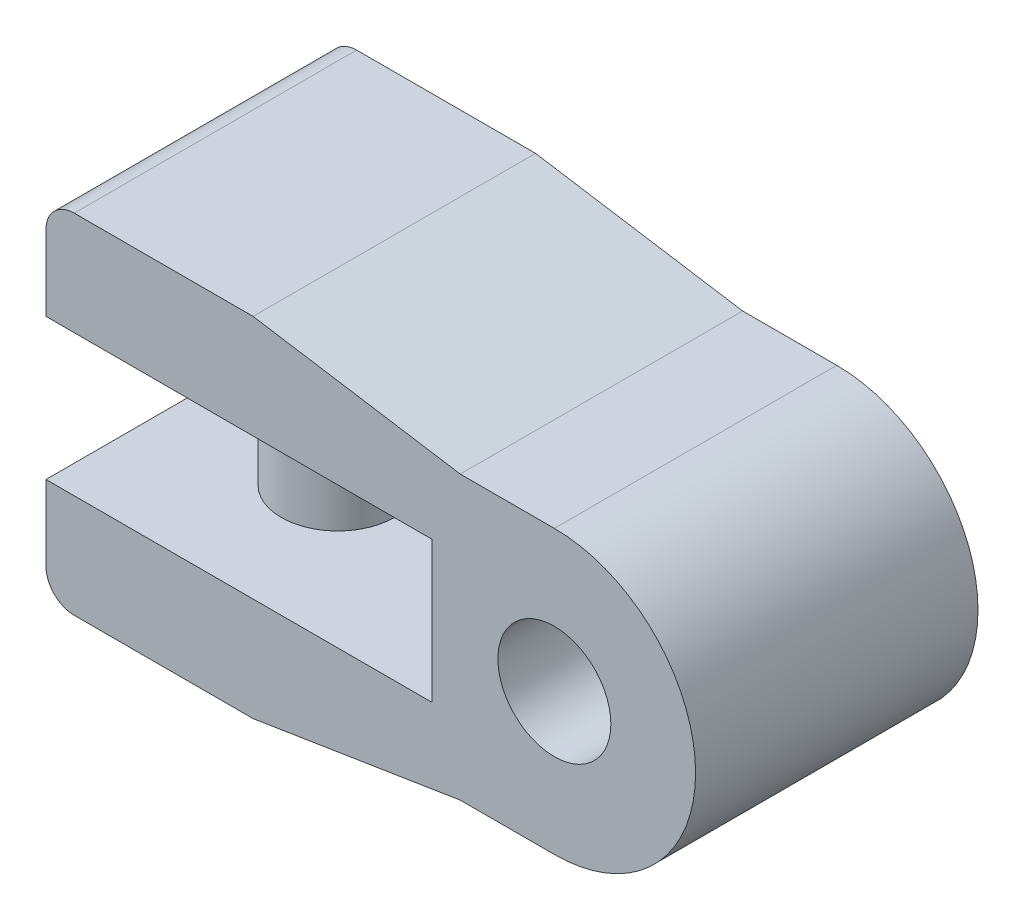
ISO-10303-21;
HEADER;
FILE_DESCRIPTION(('STEP AP214'),'2;1');
FILE_NAME('part.step','',(''),(''),'','','');
FILE_SCHEMA(('AUTOMOTIVE_DESIGN { 1 0 10303 214 1 1 1 1 }'));
ENDSEC;
DATA;
#1=APPLICATION_CONTEXT('core data for automotive mechanical design processes');
#2=APPLICATION_PROTOCOL_DEFINITION('international standard','automotive_design',2000,#1);
#3=PRODUCT_CONTEXT('',#1,'mechanical');
#4=PRODUCT('Part','Part','',(#3));
#5=PRODUCT_RELATED_PRODUCT_CATEGORY('part','',(#4));
#6=PRODUCT_DEFINITION_FORMATION('','',#4);
#7=PRODUCT_DEFINITION_CONTEXT('part definition',#1,'design');
#8=PRODUCT_DEFINITION('design','',#6,#7);
#9=PRODUCT_DEFINITION_SHAPE('','',#8);
#10=(LENGTH_UNIT() NAMED_UNIT(*) SI_UNIT(.MILLI.,.METRE.));
#11=(NAMED_UNIT(*) PLANE_ANGLE_UNIT() SI_UNIT($,.RADIAN.));
#12=(NAMED_UNIT(*) SI_UNIT($,.STERADIAN.) SOLID_ANGLE_UNIT());
#13=UNCERTAINTY_MEASURE_WITH_UNIT(LENGTH_MEASURE(1.E-05),#10,'distance_accuracy_value','');
#14=(GEOMETRIC_REPRESENTATION_CONTEXT(3) GLOBAL_UNCERTAINTY_ASSIGNED_CONTEXT((#13)) GLOBAL_UNIT_ASSIGNED_CONTEXT((#10,
#11,#12)) REPRESENTATION_CONTEXT('',''));
#15=CARTESIAN_POINT('',(0.,0.,0.));
#16=DIRECTION('',(0.,0.,1.));
#17=DIRECTION('',(1.,0.,0.));
#18=AXIS2_PLACEMENT_3D('',#15,#16,#17);
#19=CARTESIAN_POINT('',(41.,7.5,30.));
#20=DIRECTION('',(0.,1.,0.));
#21=DIRECTION('',(-1.,0.,0.));
#22=AXIS2_PLACEMENT_3D('',#19,#20,#21);
#23=PLANE('',#22);
#24=CARTESIAN_POINT('',(16.,7.5,15.));
#25=DIRECTION('',(0.,1.,0.));
#26=DIRECTION('',(-1.,0.,0.));
#27=AXIS2_PLACEMENT_3D('',#24,#25,#26);
#28=CIRCLE('',#27,6.);
#29=CARTESIAN_POINT('',(10.,7.5,15.));
#30=VERTEX_POINT('',#29);
#31=EDGE_CURVE('E255',#30,#30,#28,.T.);
#32=ORIENTED_EDGE('',*,*,#31,.T.);
#33=EDGE_LOOP('',(#32));
#34=FACE_BOUND('',#33,.T.);
#35=DIRECTION('',(1.,0.,0.));
#36=VECTOR('',#35,1.);
#37=CARTESIAN_POINT('',(41.,7.5,0.));
#38=LINE('',#37,#36);
#39=CARTESIAN_POINT('',(0.,7.5,0.));
#40=VERTEX_POINT('',#39);
#41=CARTESIAN_POINT('',(41.,7.5,0.));
#42=VERTEX_POINT('',#41);
#43=EDGE_CURVE('E154',#40,#42,#38,.T.);
#44=ORIENTED_EDGE('',*,*,#43,.T.);
#45=DIRECTION('',(0.,0.,-1.));
#46=VECTOR('',#45,1.);
#47=CARTESIAN_POINT('',(41.,7.5,30.));
#48=LINE('',#47,#46);
#49=CARTESIAN_POINT('',(41.,7.5,30.));
#50=VERTEX_POINT('',#49);
#51=EDGE_CURVE('E135',#50,#42,#48,.T.);
#52=ORIENTED_EDGE('',*,*,#51,.F.);
#53=DIRECTION('',(1.,0.,0.));
#54=VECTOR('',#53,1.);
#55=CARTESIAN_POINT('',(41.,7.5,30.));
#56=LINE('',#55,#54);
#57=CARTESIAN_POINT('',(0.,7.5,30.));
#58=VERTEX_POINT('',#57);
#59=EDGE_CURVE('E141',#58,#50,#56,.T.);
#60=ORIENTED_EDGE('',*,*,#59,.F.);
#61=DIRECTION('',(0.,0.,-1.));
#62=VECTOR('',#61,1.);
#63=CARTESIAN_POINT('',(0.,7.5,30.));
#64=LINE('',#63,#62);
#65=EDGE_CURVE('E208',#58,#40,#64,.T.);
#66=ORIENTED_EDGE('',*,*,#65,.T.);
#67=EDGE_LOOP('',(#44,#52,#60,#66));
#68=FACE_BOUND('',#67,.T.);
#69=ADVANCED_FACE('F30',(#34,#68),#23,.F.);
#70=CARTESIAN_POINT('',(41.,-7.5,30.));
#71=DIRECTION('',(1.,0.,0.));
#72=DIRECTION('',(0.,0.,-1.));
#73=AXIS2_PLACEMENT_3D('',#70,#71,#72);
#74=PLANE('',#73);
#75=DIRECTION('',(0.,-1.,0.));
#76=VECTOR('',#75,1.);
#77=CARTESIAN_POINT('',(41.,-7.5,0.));
#78=LINE('',#77,#76);
#79=CARTESIAN_POINT('',(41.,-7.5,0.));
#80=VERTEX_POINT('',#79);
#81=EDGE_CURVE('E231',#42,#80,#78,.T.);
#82=ORIENTED_EDGE('',*,*,#81,.T.);
#83=DIRECTION('',(0.,0.,-1.));
#84=VECTOR('',#83,1.);
#85=CARTESIAN_POINT('',(41.,-7.5,30.));
#86=LINE('',#85,#84);
#87=CARTESIAN_POINT('',(41.,-7.5,30.));
#88=VERTEX_POINT('',#87);
#89=EDGE_CURVE('E138',#88,#80,#86,.T.);
#90=ORIENTED_EDGE('',*,*,#89,.F.);
#91=DIRECTION('',(0.,-1.,0.));
#92=VECTOR('',#91,1.);
#93=CARTESIAN_POINT('',(41.,-7.5,30.));
#94=LINE('',#93,#92);
#95=EDGE_CURVE('E131',#50,#88,#94,.T.);
#96=ORIENTED_EDGE('',*,*,#95,.F.);
#97=ORIENTED_EDGE('',*,*,#51,.T.);
#98=EDGE_LOOP('',(#82,#90,#96,#97));
#99=FACE_BOUND('',#98,.T.);
#100=ADVANCED_FACE('F133',(#99),#74,.F.);
#101=CARTESIAN_POINT('',(41.,-7.5,30.));
#102=DIRECTION('',(0.,-1.,0.));
#103=DIRECTION('',(1.,0.,0.));
#104=AXIS2_PLACEMENT_3D('',#101,#102,#103);
#105=PLANE('',#104);
#106=CARTESIAN_POINT('',(16.,-7.5,15.));
#107=DIRECTION('',(0.,-1.,0.));
#108=DIRECTION('',(1.,0.,0.));
#109=AXIS2_PLACEMENT_3D('',#106,#107,#108);
#110=CIRCLE('',#109,6.);
#111=CARTESIAN_POINT('',(22.,-7.5,15.));
#112=VERTEX_POINT('',#111);
#113=EDGE_CURVE('E260',#112,#112,#110,.T.);
#114=ORIENTED_EDGE('',*,*,#113,.T.);
#115=EDGE_LOOP('',(#114));
#116=FACE_BOUND('',#115,.T.);
#117=DIRECTION('',(-1.,0.,0.));
#118=VECTOR('',#117,1.);
#119=CARTESIAN_POINT('',(41.,-7.5,0.));
#120=LINE('',#119,#118);
#121=CARTESIAN_POINT('',(0.,-7.5,0.));
#122=VERTEX_POINT('',#121);
#123=EDGE_CURVE('E192',#80,#122,#120,.T.);
#124=ORIENTED_EDGE('',*,*,#123,.T.);
#125=DIRECTION('',(0.,0.,-1.));
#126=VECTOR('',#125,1.);
#127=CARTESIAN_POINT('',(0.,-7.5,30.));
#128=LINE('',#127,#126);
#129=CARTESIAN_POINT('',(0.,-7.5,30.));
#130=VERTEX_POINT('',#129);
#131=EDGE_CURVE('E160',#130,#122,#128,.T.);
#132=ORIENTED_EDGE('',*,*,#131,.F.);
#133=DIRECTION('',(-1.,0.,0.));
#134=VECTOR('',#133,1.);
#135=CARTESIAN_POINT('',(41.,-7.5,30.));
#136=LINE('',#135,#134);
#137=EDGE_CURVE('E140',#88,#130,#136,.T.);
#138=ORIENTED_EDGE('',*,*,#137,.F.);
#139=ORIENTED_EDGE('',*,*,#89,.T.);
#140=EDGE_LOOP('',(#124,#132,#138,#139));
#141=FACE_BOUND('',#140,.T.);
#142=ADVANCED_FACE('F264',(#116,#141),#105,.F.);
#143=CARTESIAN_POINT('',(0.,-7.5,30.));
#144=DIRECTION('',(1.,0.,0.));
#145=DIRECTION('',(0.,1.,0.));
#146=AXIS2_PLACEMENT_3D('',#143,#144,#145);
#147=PLANE('',#146);
#148=DIRECTION('',(0.,-1.,0.));
#149=VECTOR('',#148,1.);
#150=CARTESIAN_POINT('',(0.,-7.5,0.));
#151=LINE('',#150,#149);
#152=CARTESIAN_POINT('',(0.,-15.5,0.));
#153=VERTEX_POINT('',#152);
#154=EDGE_CURVE('E188',#122,#153,#151,.T.);
#155=ORIENTED_EDGE('',*,*,#154,.T.);
#156=DIRECTION('',(0.,0.,-1.));
#157=VECTOR('',#156,1.);
#158=CARTESIAN_POINT('',(0.,-15.5,30.));
#159=LINE('',#158,#157);
#160=CARTESIAN_POINT('',(0.,-15.5,30.));
#161=VERTEX_POINT('',#160);
#162=EDGE_CURVE('E11',#153,#161,#159,.F.);
#163=ORIENTED_EDGE('',*,*,#162,.T.);
#164=DIRECTION('',(0.,-1.,0.));
#165=VECTOR('',#164,1.);
#166=CARTESIAN_POINT('',(0.,-7.5,30.));
#167=LINE('',#166,#165);
#168=EDGE_CURVE('E228',#130,#161,#167,.T.);
#169=ORIENTED_EDGE('',*,*,#168,.F.);
#170=ORIENTED_EDGE('',*,*,#131,.T.);
#171=EDGE_LOOP('',(#155,#163,#169,#170));
#172=FACE_BOUND('',#171,.T.);
#173=ADVANCED_FACE('F227',(#172),#147,.F.);
#174=CARTESIAN_POINT('',(0.,-18.5,30.));
#175=DIRECTION('',(0.,1.,0.));
#176=DIRECTION('',(0.,0.,1.));
#177=AXIS2_PLACEMENT_3D('',#174,#175,#176);
#178=PLANE('',#177);
#179=DIRECTION('',(1.,0.,0.));
#180=VECTOR('',#179,1.);
#181=CARTESIAN_POINT('',(0.,-18.5,0.));
#182=LINE('',#181,#180);
#183=CARTESIAN_POINT('',(3.,-18.5,0.));
#184=VERTEX_POINT('',#183);
#185=CARTESIAN_POINT('',(22.,-18.5,0.));
#186=VERTEX_POINT('',#185);
#187=EDGE_CURVE('E178',#184,#186,#182,.T.);
#188=ORIENTED_EDGE('',*,*,#187,.T.);
#189=DIRECTION('',(0.,0.,-1.));
#190=VECTOR('',#189,1.);
#191=CARTESIAN_POINT('',(22.,-18.5,30.));
#192=LINE('',#191,#190);
#193=CARTESIAN_POINT('',(22.,-18.5,30.));
#194=VERTEX_POINT('',#193);
#195=EDGE_CURVE('E224',#194,#186,#192,.T.);
#196=ORIENTED_EDGE('',*,*,#195,.F.);
#197=DIRECTION('',(1.,0.,0.));
#198=VECTOR('',#197,1.);
#199=CARTESIAN_POINT('',(0.,-18.5,30.));
#200=LINE('',#199,#198);
#201=CARTESIAN_POINT('',(3.,-18.5,30.));
#202=VERTEX_POINT('',#201);
#203=EDGE_CURVE('E180',#202,#194,#200,.T.);
#204=ORIENTED_EDGE('',*,*,#203,.F.);
#205=DIRECTION('',(0.,0.,-1.));
#206=VECTOR('',#205,1.);
#207=CARTESIAN_POINT('',(3.,-18.5,30.));
#208=LINE('',#207,#206);
#209=EDGE_CURVE('E38',#202,#184,#208,.T.);
#210=ORIENTED_EDGE('',*,*,#209,.T.);
#211=EDGE_LOOP('',(#188,#196,#204,#210));
#212=FACE_BOUND('',#211,.T.);
#213=ADVANCED_FACE('F176',(#212),#178,.F.);
#214=CARTESIAN_POINT('',(22.,-18.5,30.));
#215=DIRECTION('',(-0.157115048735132,0.987580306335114,0.));
#216=DIRECTION('',(-0.987580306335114,-0.157115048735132,0.));
#217=AXIS2_PLACEMENT_3D('',#214,#215,#216);
#218=PLANE('',#217);
#219=DIRECTION('',(0.987580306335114,0.157115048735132,0.));
#220=VECTOR('',#219,1.);
#221=CARTESIAN_POINT('',(22.,-18.5,0.));
#222=LINE('',#221,#220);
#223=CARTESIAN_POINT('',(44.,-15.,0.));
#224=VERTEX_POINT('',#223);
#225=EDGE_CURVE('E187',#186,#224,#222,.T.);
#226=ORIENTED_EDGE('',*,*,#225,.T.);
#227=DIRECTION('',(0.,0.,-1.));
#228=VECTOR('',#227,1.);
#229=CARTESIAN_POINT('',(44.,-15.,30.));
#230=LINE('',#229,#228);
#231=CARTESIAN_POINT('',(44.,-15.,30.));
#232=VERTEX_POINT('',#231);
#233=EDGE_CURVE('E221',#232,#224,#230,.T.);
#234=ORIENTED_EDGE('',*,*,#233,.F.);
#235=DIRECTION('',(0.987580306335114,0.157115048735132,0.));
#236=VECTOR('',#235,1.);
#237=CARTESIAN_POINT('',(22.,-18.5,30.));
#238=LINE('',#237,#236);
#239=EDGE_CURVE('E247',#194,#232,#238,.T.);
#240=ORIENTED_EDGE('',*,*,#239,.F.);
#241=ORIENTED_EDGE('',*,*,#195,.T.);
#242=EDGE_LOOP('',(#226,#234,#240,#241));
#243=FACE_BOUND('',#242,.T.);
#244=ADVANCED_FACE('F320',(#243),#218,.F.);
#245=CARTESIAN_POINT('',(44.,-15.,30.));
#246=DIRECTION('',(0.,1.,0.));
#247=DIRECTION('',(0.,0.,1.));
#248=AXIS2_PLACEMENT_3D('',#245,#246,#247);
#249=PLANE('',#248);
#250=DIRECTION('',(1.,0.,0.));
#251=VECTOR('',#250,1.);
#252=CARTESIAN_POINT('',(44.,-15.,0.));
#253=LINE('',#252,#251);
#254=CARTESIAN_POINT('',(54.,-15.,0.));
#255=VERTEX_POINT('',#254);
#256=EDGE_CURVE('E190',#224,#255,#253,.T.);
#257=ORIENTED_EDGE('',*,*,#256,.T.);
#258=DIRECTION('',(0.,0.,-1.));
#259=VECTOR('',#258,1.);
#260=CARTESIAN_POINT('',(54.,-15.,30.));
#261=LINE('',#260,#259);
#262=CARTESIAN_POINT('',(54.,-15.,30.));
#263=VERTEX_POINT('',#262);
#264=EDGE_CURVE('E218',#263,#255,#261,.T.);
#265=ORIENTED_EDGE('',*,*,#264,.F.);
#266=DIRECTION('',(1.,0.,0.));
#267=VECTOR('',#266,1.);
#268=CARTESIAN_POINT('',(44.,-15.,30.));
#269=LINE('',#268,#267);
#270=EDGE_CURVE('E245',#232,#263,#269,.T.);
#271=ORIENTED_EDGE('',*,*,#270,.F.);
#272=ORIENTED_EDGE('',*,*,#233,.T.);
#273=EDGE_LOOP('',(#257,#265,#271,#272));
#274=FACE_BOUND('',#273,.T.);
#275=ADVANCED_FACE('F316',(#274),#249,.F.);
#276=CARTESIAN_POINT('',(54.,0.,30.));
#277=DIRECTION('',(0.,0.,-1.));
#278=DIRECTION('',(-1.,0.,0.));
#279=AXIS2_PLACEMENT_3D('',#276,#277,#278);
#280=CYLINDRICAL_SURFACE('',#279,15.);
#281=CARTESIAN_POINT('',(54.,0.,0.));
#282=DIRECTION('',(0.,0.,1.));
#283=DIRECTION('',(-1.,0.,0.));
#284=AXIS2_PLACEMENT_3D('',#281,#282,#283);
#285=CIRCLE('',#284,15.);
#286=CARTESIAN_POINT('',(54.,15.,0.));
#287=VERTEX_POINT('',#286);
#288=EDGE_CURVE('E197',#255,#287,#285,.T.);
#289=ORIENTED_EDGE('',*,*,#288,.T.);
#290=DIRECTION('',(0.,0.,-1.));
#291=VECTOR('',#290,1.);
#292=CARTESIAN_POINT('',(54.,15.,30.));
#293=LINE('',#292,#291);
#294=CARTESIAN_POINT('',(54.,15.,30.));
#295=VERTEX_POINT('',#294);
#296=EDGE_CURVE('E215',#295,#287,#293,.T.);
#297=ORIENTED_EDGE('',*,*,#296,.F.);
#298=CARTESIAN_POINT('',(54.,0.,30.));
#299=DIRECTION('',(0.,0.,1.));
#300=DIRECTION('',(-1.,0.,0.));
#301=AXIS2_PLACEMENT_3D('',#298,#299,#300);
#302=CIRCLE('',#301,15.);
#303=EDGE_CURVE('E243',#263,#295,#302,.T.);
#304=ORIENTED_EDGE('',*,*,#303,.F.);
#305=ORIENTED_EDGE('',*,*,#264,.T.);
#306=EDGE_LOOP('',(#289,#297,#304,#305));
#307=FACE_BOUND('',#306,.T.);
#308=ADVANCED_FACE('F312',(#307),#280,.T.);
#309=CARTESIAN_POINT('',(44.,15.,30.));
#310=DIRECTION('',(0.,-1.,0.));
#311=DIRECTION('',(0.,0.,-1.));
#312=AXIS2_PLACEMENT_3D('',#309,#310,#311);
#313=PLANE('',#312);
#314=DIRECTION('',(-1.,0.,0.));
#315=VECTOR('',#314,1.);
#316=CARTESIAN_POINT('',(44.,15.,0.));
#317=LINE('',#316,#315);
#318=CARTESIAN_POINT('',(44.,15.,0.));
#319=VERTEX_POINT('',#318);
#320=EDGE_CURVE('E199',#287,#319,#317,.T.);
#321=ORIENTED_EDGE('',*,*,#320,.T.);
#322=DIRECTION('',(0.,0.,-1.));
#323=VECTOR('',#322,1.);
#324=CARTESIAN_POINT('',(44.,15.,30.));
#325=LINE('',#324,#323);
#326=CARTESIAN_POINT('',(44.,15.,30.));
#327=VERTEX_POINT('',#326);
#328=EDGE_CURVE('E212',#327,#319,#325,.T.);
#329=ORIENTED_EDGE('',*,*,#328,.F.);
#330=DIRECTION('',(-1.,0.,0.));
#331=VECTOR('',#330,1.);
#332=CARTESIAN_POINT('',(44.,15.,30.));
#333=LINE('',#332,#331);
#334=EDGE_CURVE('E241',#295,#327,#333,.T.);
#335=ORIENTED_EDGE('',*,*,#334,.F.);
#336=ORIENTED_EDGE('',*,*,#296,.T.);
#337=EDGE_LOOP('',(#321,#329,#335,#336));
#338=FACE_BOUND('',#337,.T.);
#339=ADVANCED_FACE('F307',(#338),#313,.F.);
#340=CARTESIAN_POINT('',(22.,18.5,30.));
#341=DIRECTION('',(-0.157115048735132,-0.987580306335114,0.));
#342=DIRECTION('',(0.987580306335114,-0.157115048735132,0.));
#343=AXIS2_PLACEMENT_3D('',#340,#341,#342);
#344=PLANE('',#343);
#345=DIRECTION('',(-0.987580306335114,0.157115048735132,0.));
#346=VECTOR('',#345,1.);
#347=CARTESIAN_POINT('',(22.,18.5,0.));
#348=LINE('',#347,#346);
#349=CARTESIAN_POINT('',(22.,18.5,0.));
#350=VERTEX_POINT('',#349);
#351=EDGE_CURVE('E201',#319,#350,#348,.T.);
#352=ORIENTED_EDGE('',*,*,#351,.T.);
#353=DIRECTION('',(0.,0.,-1.));
#354=VECTOR('',#353,1.);
#355=CARTESIAN_POINT('',(22.,18.5,30.));
#356=LINE('',#355,#354);
#357=CARTESIAN_POINT('',(22.,18.5,30.));
#358=VERTEX_POINT('',#357);
#359=EDGE_CURVE('E210',#358,#350,#356,.T.);
#360=ORIENTED_EDGE('',*,*,#359,.F.);
#361=DIRECTION('',(-0.987580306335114,0.157115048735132,0.));
#362=VECTOR('',#361,1.);
#363=CARTESIAN_POINT('',(22.,18.5,30.));
#364=LINE('',#363,#362);
#365=EDGE_CURVE('E239',#327,#358,#364,.T.);
#366=ORIENTED_EDGE('',*,*,#365,.F.);
#367=ORIENTED_EDGE('',*,*,#328,.T.);
#368=EDGE_LOOP('',(#352,#360,#366,#367));
#369=FACE_BOUND('',#368,.T.);
#370=ADVANCED_FACE('F302',(#369),#344,.F.);
#371=CARTESIAN_POINT('',(0.,18.5,30.));
#372=DIRECTION('',(0.,-1.,0.));
#373=DIRECTION('',(0.,0.,-1.));
#374=AXIS2_PLACEMENT_3D('',#371,#372,#373);
#375=PLANE('',#374);
#376=ORIENTED_EDGE('',*,*,#359,.T.);
#377=DIRECTION('',(-1.,0.,0.));
#378=VECTOR('',#377,1.);
#379=CARTESIAN_POINT('',(0.,18.5,0.));
#380=LINE('',#379,#378);
#381=CARTESIAN_POINT('',(3.,18.5,0.));
#382=VERTEX_POINT('',#381);
#383=EDGE_CURVE('E204',#350,#382,#380,.T.);
#384=ORIENTED_EDGE('',*,*,#383,.T.);
#385=DIRECTION('',(0.,0.,-1.));
#386=VECTOR('',#385,1.);
#387=CARTESIAN_POINT('',(3.,18.5,30.));
#388=LINE('',#387,#386);
#389=CARTESIAN_POINT('',(3.,18.5,30.));
#390=VERTEX_POINT('',#389);
#391=EDGE_CURVE('E167',#382,#390,#388,.F.);
#392=ORIENTED_EDGE('',*,*,#391,.T.);
#393=DIRECTION('',(-1.,0.,0.));
#394=VECTOR('',#393,1.);
#395=CARTESIAN_POINT('',(0.,18.5,30.));
#396=LINE('',#395,#394);
#397=EDGE_CURVE('E237',#358,#390,#396,.T.);
#398=ORIENTED_EDGE('',*,*,#397,.F.);
#399=EDGE_LOOP('',(#376,#384,#392,#398));
#400=FACE_BOUND('',#399,.T.);
#401=ADVANCED_FACE('F298',(#400),#375,.F.);
#402=CARTESIAN_POINT('',(0.,7.5,30.));
#403=DIRECTION('',(1.,0.,0.));
#404=DIRECTION('',(0.,1.,0.));
#405=AXIS2_PLACEMENT_3D('',#402,#403,#404);
#406=PLANE('',#405);
#407=DIRECTION('',(0.,-1.,0.));
#408=VECTOR('',#407,1.);
#409=CARTESIAN_POINT('',(0.,7.5,30.));
#410=LINE('',#409,#408);
#411=CARTESIAN_POINT('',(0.,15.5,30.));
#412=VERTEX_POINT('',#411);
#413=EDGE_CURVE('E147',#412,#58,#410,.T.);
#414=ORIENTED_EDGE('',*,*,#413,.F.);
#415=DIRECTION('',(0.,0.,-1.));
#416=VECTOR('',#415,1.);
#417=CARTESIAN_POINT('',(0.,15.5,30.));
#418=LINE('',#417,#416);
#419=CARTESIAN_POINT('',(0.,15.5,0.));
#420=VERTEX_POINT('',#419);
#421=EDGE_CURVE('E155',#412,#420,#418,.T.);
#422=ORIENTED_EDGE('',*,*,#421,.T.);
#423=DIRECTION('',(0.,-1.,0.));
#424=VECTOR('',#423,1.);
#425=CARTESIAN_POINT('',(0.,7.5,0.));
#426=LINE('',#425,#424);
#427=EDGE_CURVE('E151',#420,#40,#426,.T.);
#428=ORIENTED_EDGE('',*,*,#427,.T.);
#429=ORIENTED_EDGE('',*,*,#65,.F.);
#430=EDGE_LOOP('',(#414,#422,#428,#429));
#431=FACE_BOUND('',#430,.T.);
#432=ADVANCED_FACE('F294',(#431),#406,.F.);
#433=CARTESIAN_POINT('',(54.,0.,30.));
#434=DIRECTION('',(0.,0.,-1.));
#435=DIRECTION('',(-1.,0.,0.));
#436=AXIS2_PLACEMENT_3D('',#433,#434,#435);
#437=PLANE('',#436);
#438=CARTESIAN_POINT('',(54.,0.,30.));
#439=DIRECTION('',(0.,0.,1.));
#440=DIRECTION('',(1.,0.,0.));
#441=AXIS2_PLACEMENT_3D('',#438,#439,#440);
#442=CIRCLE('',#441,6.);
#443=CARTESIAN_POINT('',(60.,0.,30.));
#444=VERTEX_POINT('',#443);
#445=EDGE_CURVE('E252',#444,#444,#442,.T.);
#446=ORIENTED_EDGE('',*,*,#445,.F.);
#447=EDGE_LOOP('',(#446));
#448=FACE_BOUND('',#447,.T.);
#449=ORIENTED_EDGE('',*,*,#397,.T.);
#450=CARTESIAN_POINT('',(3.,15.5,30.));
#451=DIRECTION('',(0.,0.,-1.));
#452=DIRECTION('',(-1.,0.,0.));
#453=AXIS2_PLACEMENT_3D('',#450,#451,#452);
#454=CIRCLE('',#453,3.);
#455=EDGE_CURVE('E170',#390,#412,#454,.F.);
#456=ORIENTED_EDGE('',*,*,#455,.T.);
#457=ORIENTED_EDGE('',*,*,#413,.T.);
#458=ORIENTED_EDGE('',*,*,#59,.T.);
#459=ORIENTED_EDGE('',*,*,#95,.T.);
#460=ORIENTED_EDGE('',*,*,#137,.T.);
#461=ORIENTED_EDGE('',*,*,#168,.T.);
#462=CARTESIAN_POINT('',(3.,-15.5,30.));
#463=DIRECTION('',(0.,0.,-1.));
#464=DIRECTION('',(-1.,0.,0.));
#465=AXIS2_PLACEMENT_3D('',#462,#463,#464);
#466=CIRCLE('',#465,3.);
#467=EDGE_CURVE('E45',#161,#202,#466,.F.);
#468=ORIENTED_EDGE('',*,*,#467,.T.);
#469=ORIENTED_EDGE('',*,*,#203,.T.);
#470=ORIENTED_EDGE('',*,*,#239,.T.);
#471=ORIENTED_EDGE('',*,*,#270,.T.);
#472=ORIENTED_EDGE('',*,*,#303,.T.);
#473=ORIENTED_EDGE('',*,*,#334,.T.);
#474=ORIENTED_EDGE('',*,*,#365,.T.);
#475=EDGE_LOOP('',(#449,#456,#457,#458,#459,#460,#461,#468,#469,#470,#471,#472,#473,#474));
#476=FACE_BOUND('',#475,.T.);
#477=ADVANCED_FACE('F145',(#448,#476),#437,.F.);
#478=CARTESIAN_POINT('',(54.,0.,0.));
#479=DIRECTION('',(0.,0.,-1.));
#480=DIRECTION('',(-1.,0.,0.));
#481=AXIS2_PLACEMENT_3D('',#478,#479,#480);
#482=PLANE('',#481);
#483=CARTESIAN_POINT('',(54.,0.,0.));
#484=DIRECTION('',(0.,0.,1.));
#485=DIRECTION('',(1.,0.,0.));
#486=AXIS2_PLACEMENT_3D('',#483,#484,#485);
#487=CIRCLE('',#486,6.);
#488=CARTESIAN_POINT('',(60.,0.,0.));
#489=VERTEX_POINT('',#488);
#490=EDGE_CURVE('E235',#489,#489,#487,.T.);
#491=ORIENTED_EDGE('',*,*,#490,.T.);
#492=EDGE_LOOP('',(#491));
#493=FACE_BOUND('',#492,.T.);
#494=ORIENTED_EDGE('',*,*,#427,.F.);
#495=CARTESIAN_POINT('',(3.,15.5,0.));
#496=DIRECTION('',(0.,0.,-1.));
#497=DIRECTION('',(-1.,0.,0.));
#498=AXIS2_PLACEMENT_3D('',#495,#496,#497);
#499=CIRCLE('',#498,3.);
#500=EDGE_CURVE('E165',#420,#382,#499,.T.);
#501=ORIENTED_EDGE('',*,*,#500,.T.);
#502=ORIENTED_EDGE('',*,*,#383,.F.);
#503=ORIENTED_EDGE('',*,*,#351,.F.);
#504=ORIENTED_EDGE('',*,*,#320,.F.);
#505=ORIENTED_EDGE('',*,*,#288,.F.);
#506=ORIENTED_EDGE('',*,*,#256,.F.);
#507=ORIENTED_EDGE('',*,*,#225,.F.);
#508=ORIENTED_EDGE('',*,*,#187,.F.);
#509=CARTESIAN_POINT('',(3.,-15.5,0.));
#510=DIRECTION('',(0.,0.,-1.));
#511=DIRECTION('',(-1.,0.,0.));
#512=AXIS2_PLACEMENT_3D('',#509,#510,#511);
#513=CIRCLE('',#512,3.);
#514=EDGE_CURVE('E158',#184,#153,#513,.T.);
#515=ORIENTED_EDGE('',*,*,#514,.T.);
#516=ORIENTED_EDGE('',*,*,#154,.F.);
#517=ORIENTED_EDGE('',*,*,#123,.F.);
#518=ORIENTED_EDGE('',*,*,#81,.F.);
#519=ORIENTED_EDGE('',*,*,#43,.F.);
#520=EDGE_LOOP('',(#494,#501,#502,#503,#504,#505,#506,#507,#508,#515,#516,#517,#518,#519));
#521=FACE_BOUND('',#520,.T.);
#522=ADVANCED_FACE('F184',(#493,#521),#482,.T.);
#523=CARTESIAN_POINT('',(54.,0.,0.));
#524=DIRECTION('',(0.,0.,1.));
#525=DIRECTION('',(1.,0.,0.));
#526=AXIS2_PLACEMENT_3D('',#523,#524,#525);
#527=CYLINDRICAL_SURFACE('',#526,6.);
#528=ORIENTED_EDGE('',*,*,#490,.F.);
#529=EDGE_LOOP('',(#528));
#530=FACE_BOUND('',#529,.T.);
#531=ORIENTED_EDGE('',*,*,#445,.T.);
#532=EDGE_LOOP('',(#531));
#533=FACE_BOUND('',#532,.T.);
#534=ADVANCED_FACE('F281',(#530,#533),#527,.F.);
#535=CARTESIAN_POINT('',(3.,15.5,30.));
#536=DIRECTION('',(0.,0.,-1.));
#537=DIRECTION('',(-1.,0.,0.));
#538=AXIS2_PLACEMENT_3D('',#535,#536,#537);
#539=CYLINDRICAL_SURFACE('',#538,3.);
#540=ORIENTED_EDGE('',*,*,#455,.F.);
#541=ORIENTED_EDGE('',*,*,#391,.F.);
#542=ORIENTED_EDGE('',*,*,#500,.F.);
#543=ORIENTED_EDGE('',*,*,#421,.F.);
#544=EDGE_LOOP('',(#540,#541,#542,#543));
#545=FACE_BOUND('',#544,.T.);
#546=ADVANCED_FACE('F279',(#545),#539,.T.);
#547=CARTESIAN_POINT('',(3.,-15.5,30.));
#548=DIRECTION('',(0.,0.,-1.));
#549=DIRECTION('',(-1.,0.,0.));
#550=AXIS2_PLACEMENT_3D('',#547,#548,#549);
#551=CYLINDRICAL_SURFACE('',#550,3.);
#552=ORIENTED_EDGE('',*,*,#467,.F.);
#553=ORIENTED_EDGE('',*,*,#162,.F.);
#554=ORIENTED_EDGE('',*,*,#514,.F.);
#555=ORIENTED_EDGE('',*,*,#209,.F.);
#556=EDGE_LOOP('',(#552,#553,#554,#555));
#557=FACE_BOUND('',#556,.T.);
#558=ADVANCED_FACE('F32',(#557),#551,.T.);
#559=CARTESIAN_POINT('',(16.,-18.5,15.));
#560=DIRECTION('',(0.,1.,0.));
#561=DIRECTION('',(0.,0.,1.));
#562=AXIS2_PLACEMENT_3D('',#559,#560,#561);
#563=CYLINDRICAL_SURFACE('',#562,6.);
#564=ORIENTED_EDGE('',*,*,#113,.F.);
#565=EDGE_LOOP('',(#564));
#566=FACE_BOUND('',#565,.T.);
#567=ORIENTED_EDGE('',*,*,#31,.F.);
#568=EDGE_LOOP('',(#567));
#569=FACE_BOUND('',#568,.T.);
#570=ADVANCED_FACE('F266',(#566,#569),#563,.T.);
#571=CLOSED_SHELL('',(#69,#100,#142,#173,#213,#244,#275,#308,#339,#370,#401,#432,#477,#522,#534,
#546,#558,#570));
#572=MANIFOLD_SOLID_BREP('B2',#571);
#573=ADVANCED_BREP_SHAPE_REPRESENTATION('',(#18,#572),#14);
#574=SHAPE_DEFINITION_REPRESENTATION(#9,#573);
ENDSEC;
END-ISO-10303-21;
